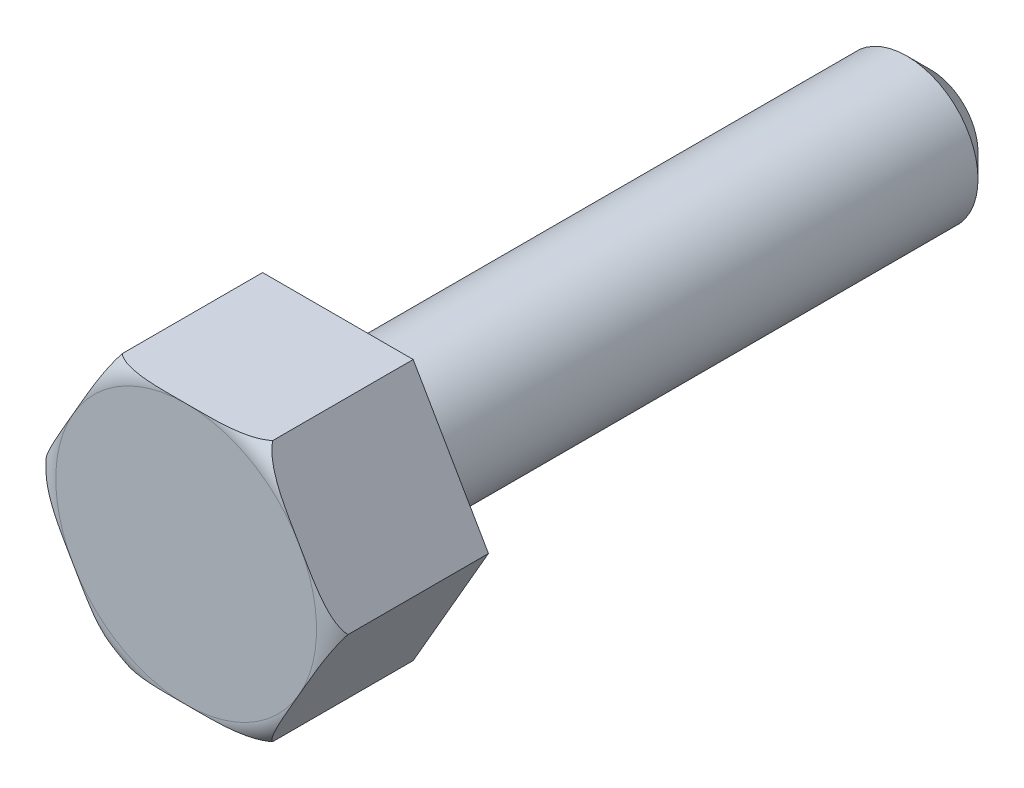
from build123d import *

# Parameters (mm, degrees)
ESQUISSE1_R             = 6.5
EXTRUSION1_DEPTH        = 6.4
CONG_1_R                = 1
ESQUISSE2_R             = 14.142135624
ENL_V_MAT_EXTRU_1_DEPTH = 12.20089288
ESQUISSE3_R             = 3
EXTRUSION2_DEPTH        = 25
CHANFREIN1_SIZE         = 1


with BuildPart() as part:
    # Esquisse1 → Extrusion1 (new body)
    with BuildSketch(Plane.XY):
        Circle(ESQUISSE1_R)
    extrude(amount=EXTRUSION1_DEPTH)

    # Cong_1
    cong_1_edges = [part.edges().sort_by_distance(p)[0] for p in [
        (-6.5, 0, 6.4),
    ]]
    fillet(cong_1_edges, radius=CONG_1_R)

    # Esquisse2 → Enl_v. mat.-Extru.1 (cut, through all)
    with BuildSketch(Plane.XY.offset(6.4)):
        Circle(ESQUISSE2_R)
        Polygon((6.350852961, 0), (3.175426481, 5.5), (-3.175426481, 5.5), (-6.350852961, 0), (-3.175426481, -5.5), (3.175426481, -5.5), align=None, mode=Mode.SUBTRACT)
    extrude(amount=-ENL_V_MAT_EXTRU_1_DEPTH, mode=Mode.SUBTRACT)

    # Esquisse3 → Extrusion2 (add)
    with BuildSketch(Plane(origin=(0, 0, 0), x_dir=(-1, 0, 0), z_dir=(0, 0, -1))):
        with Locations(Location((0, 0, 0), (0, 0, 180))):
            Circle(ESQUISSE3_R)
    extrude(amount=EXTRUSION2_DEPTH)

    # Chanfrein1
    chanfrein1_edges = [part.edges().sort_by_distance(p)[0] for p in [
        (-3, 0, -25),
    ]]
    chamfer(chanfrein1_edges, length=CHANFREIN1_SIZE)


solid = part.part
